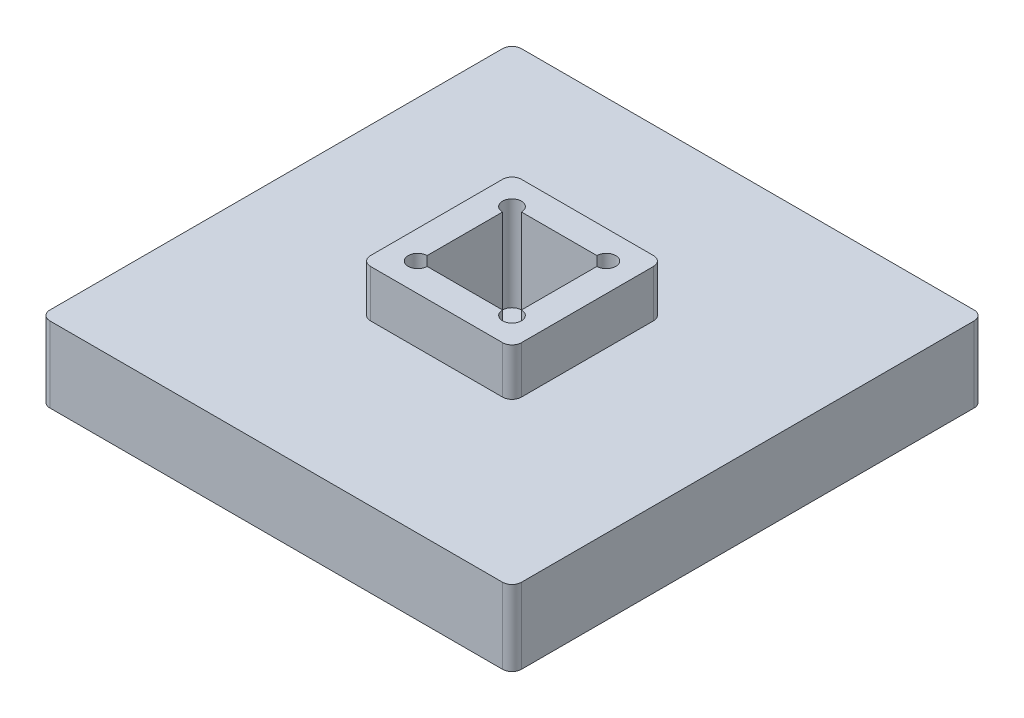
ISO-10303-21;
HEADER;
FILE_DESCRIPTION(('STEP AP214'),'2;1');
FILE_NAME('part.step','',(''),(''),'','','');
FILE_SCHEMA(('AUTOMOTIVE_DESIGN { 1 0 10303 214 1 1 1 1 }'));
ENDSEC;
DATA;
#1=APPLICATION_CONTEXT('core data for automotive mechanical design processes');
#2=APPLICATION_PROTOCOL_DEFINITION('international standard','automotive_design',2000,#1);
#3=PRODUCT_CONTEXT('',#1,'mechanical');
#4=PRODUCT('Part','Part','',(#3));
#5=PRODUCT_RELATED_PRODUCT_CATEGORY('part','',(#4));
#6=PRODUCT_DEFINITION_FORMATION('','',#4);
#7=PRODUCT_DEFINITION_CONTEXT('part definition',#1,'design');
#8=PRODUCT_DEFINITION('design','',#6,#7);
#9=PRODUCT_DEFINITION_SHAPE('','',#8);
#10=(LENGTH_UNIT() NAMED_UNIT(*) SI_UNIT(.MILLI.,.METRE.));
#11=(NAMED_UNIT(*) PLANE_ANGLE_UNIT() SI_UNIT($,.RADIAN.));
#12=(NAMED_UNIT(*) SI_UNIT($,.STERADIAN.) SOLID_ANGLE_UNIT());
#13=UNCERTAINTY_MEASURE_WITH_UNIT(LENGTH_MEASURE(1.E-05),#10,'distance_accuracy_value','');
#14=(GEOMETRIC_REPRESENTATION_CONTEXT(3) GLOBAL_UNCERTAINTY_ASSIGNED_CONTEXT((#13)) GLOBAL_UNIT_ASSIGNED_CONTEXT((#10,
#11,#12)) REPRESENTATION_CONTEXT('',''));
#15=CARTESIAN_POINT('',(0.,0.,0.));
#16=DIRECTION('',(0.,0.,1.));
#17=DIRECTION('',(1.,0.,0.));
#18=AXIS2_PLACEMENT_3D('',#15,#16,#17);
#19=CARTESIAN_POINT('',(0.,8.,0.));
#20=DIRECTION('',(0.,-1.,0.));
#21=DIRECTION('',(0.,0.,-1.));
#22=AXIS2_PLACEMENT_3D('',#19,#20,#21);
#23=PLANE('',#22);
#24=DIRECTION('',(-1.,0.,0.));
#25=VECTOR('',#24,1.);
#26=CARTESIAN_POINT('',(-25.,8.,-25.));
#27=LINE('',#26,#25);
#28=CARTESIAN_POINT('',(24.,8.,-25.));
#29=VERTEX_POINT('',#28);
#30=CARTESIAN_POINT('',(-24.,8.,-25.));
#31=VERTEX_POINT('',#30);
#32=EDGE_CURVE('E299',#29,#31,#27,.T.);
#33=ORIENTED_EDGE('',*,*,#32,.T.);
#34=CARTESIAN_POINT('',(-24.,8.,-24.));
#35=DIRECTION('',(0.,-1.,0.));
#36=DIRECTION('',(0.,0.,-1.));
#37=AXIS2_PLACEMENT_3D('',#34,#35,#36);
#38=CIRCLE('',#37,1.);
#39=CARTESIAN_POINT('',(-25.,8.,-24.));
#40=VERTEX_POINT('',#39);
#41=EDGE_CURVE('E367',#31,#40,#38,.F.);
#42=ORIENTED_EDGE('',*,*,#41,.T.);
#43=DIRECTION('',(0.,0.,1.));
#44=VECTOR('',#43,1.);
#45=CARTESIAN_POINT('',(-25.,8.,25.));
#46=LINE('',#45,#44);
#47=CARTESIAN_POINT('',(-25.,8.,24.));
#48=VERTEX_POINT('',#47);
#49=EDGE_CURVE('E303',#40,#48,#46,.T.);
#50=ORIENTED_EDGE('',*,*,#49,.T.);
#51=CARTESIAN_POINT('',(-24.,8.,24.));
#52=DIRECTION('',(0.,-1.,0.));
#53=DIRECTION('',(0.,0.,-1.));
#54=AXIS2_PLACEMENT_3D('',#51,#52,#53);
#55=CIRCLE('',#54,1.);
#56=CARTESIAN_POINT('',(-24.,8.,25.));
#57=VERTEX_POINT('',#56);
#58=EDGE_CURVE('E58',#48,#57,#55,.F.);
#59=ORIENTED_EDGE('',*,*,#58,.T.);
#60=DIRECTION('',(1.,0.,0.));
#61=VECTOR('',#60,1.);
#62=CARTESIAN_POINT('',(-25.,8.,25.));
#63=LINE('',#62,#61);
#64=CARTESIAN_POINT('',(24.,8.,25.));
#65=VERTEX_POINT('',#64);
#66=EDGE_CURVE('E305',#57,#65,#63,.T.);
#67=ORIENTED_EDGE('',*,*,#66,.T.);
#68=CARTESIAN_POINT('',(24.,8.,24.));
#69=DIRECTION('',(0.,-1.,0.));
#70=DIRECTION('',(0.,0.,-1.));
#71=AXIS2_PLACEMENT_3D('',#68,#69,#70);
#72=CIRCLE('',#71,1.);
#73=CARTESIAN_POINT('',(25.,8.,24.));
#74=VERTEX_POINT('',#73);
#75=EDGE_CURVE('E364',#65,#74,#72,.F.);
#76=ORIENTED_EDGE('',*,*,#75,.T.);
#77=DIRECTION('',(0.,0.,-1.));
#78=VECTOR('',#77,1.);
#79=CARTESIAN_POINT('',(25.,8.,25.));
#80=LINE('',#79,#78);
#81=CARTESIAN_POINT('',(25.,8.,-24.));
#82=VERTEX_POINT('',#81);
#83=EDGE_CURVE('E296',#74,#82,#80,.T.);
#84=ORIENTED_EDGE('',*,*,#83,.T.);
#85=CARTESIAN_POINT('',(24.,8.,-24.));
#86=DIRECTION('',(0.,-1.,0.));
#87=DIRECTION('',(0.,0.,-1.));
#88=AXIS2_PLACEMENT_3D('',#85,#86,#87);
#89=CIRCLE('',#88,1.);
#90=EDGE_CURVE('E362',#82,#29,#89,.F.);
#91=ORIENTED_EDGE('',*,*,#90,.T.);
#92=EDGE_LOOP('',(#33,#42,#50,#59,#67,#76,#84,#91));
#93=FACE_BOUND('',#92,.T.);
#94=DIRECTION('',(1.,0.,0.));
#95=VECTOR('',#94,1.);
#96=CARTESIAN_POINT('',(0.,8.,8.));
#97=LINE('',#96,#95);
#98=CARTESIAN_POINT('',(-7.,8.,8.));
#99=VERTEX_POINT('',#98);
#100=CARTESIAN_POINT('',(7.,8.,8.));
#101=VERTEX_POINT('',#100);
#102=EDGE_CURVE('E239',#99,#101,#97,.T.);
#103=ORIENTED_EDGE('',*,*,#102,.F.);
#104=CARTESIAN_POINT('',(-7.,8.,7.));
#105=DIRECTION('',(0.,-1.,0.));
#106=DIRECTION('',(0.,0.,-1.));
#107=AXIS2_PLACEMENT_3D('',#104,#105,#106);
#108=CIRCLE('',#107,1.);
#109=CARTESIAN_POINT('',(-8.,8.,7.));
#110=VERTEX_POINT('',#109);
#111=EDGE_CURVE('E11',#99,#110,#108,.T.);
#112=ORIENTED_EDGE('',*,*,#111,.T.);
#113=DIRECTION('',(0.,0.,-1.));
#114=VECTOR('',#113,1.);
#115=CARTESIAN_POINT('',(-8.,8.,0.));
#116=LINE('',#115,#114);
#117=CARTESIAN_POINT('',(-8.,8.,-7.));
#118=VERTEX_POINT('',#117);
#119=EDGE_CURVE('E244',#110,#118,#116,.T.);
#120=ORIENTED_EDGE('',*,*,#119,.T.);
#121=CARTESIAN_POINT('',(-7.,8.,-7.));
#122=DIRECTION('',(0.,-1.,0.));
#123=DIRECTION('',(0.,0.,-1.));
#124=AXIS2_PLACEMENT_3D('',#121,#122,#123);
#125=CIRCLE('',#124,1.);
#126=CARTESIAN_POINT('',(-7.,8.,-8.));
#127=VERTEX_POINT('',#126);
#128=EDGE_CURVE('E44',#118,#127,#125,.T.);
#129=ORIENTED_EDGE('',*,*,#128,.T.);
#130=DIRECTION('',(1.,0.,0.));
#131=VECTOR('',#130,1.);
#132=CARTESIAN_POINT('',(0.,8.,-8.));
#133=LINE('',#132,#131);
#134=CARTESIAN_POINT('',(7.,8.,-8.));
#135=VERTEX_POINT('',#134);
#136=EDGE_CURVE('E279',#127,#135,#133,.T.);
#137=ORIENTED_EDGE('',*,*,#136,.T.);
#138=CARTESIAN_POINT('',(7.,8.,-7.));
#139=DIRECTION('',(0.,-1.,0.));
#140=DIRECTION('',(0.,0.,-1.));
#141=AXIS2_PLACEMENT_3D('',#138,#139,#140);
#142=CIRCLE('',#141,1.);
#143=CARTESIAN_POINT('',(8.,8.,-7.));
#144=VERTEX_POINT('',#143);
#145=EDGE_CURVE('E380',#135,#144,#142,.T.);
#146=ORIENTED_EDGE('',*,*,#145,.T.);
#147=DIRECTION('',(0.,0.,-1.));
#148=VECTOR('',#147,1.);
#149=CARTESIAN_POINT('',(8.,8.,0.));
#150=LINE('',#149,#148);
#151=CARTESIAN_POINT('',(8.,8.,7.));
#152=VERTEX_POINT('',#151);
#153=EDGE_CURVE('E276',#152,#144,#150,.T.);
#154=ORIENTED_EDGE('',*,*,#153,.F.);
#155=CARTESIAN_POINT('',(7.,8.,7.));
#156=DIRECTION('',(0.,-1.,0.));
#157=DIRECTION('',(0.,0.,-1.));
#158=AXIS2_PLACEMENT_3D('',#155,#156,#157);
#159=CIRCLE('',#158,1.);
#160=EDGE_CURVE('E378',#152,#101,#159,.T.);
#161=ORIENTED_EDGE('',*,*,#160,.T.);
#162=EDGE_LOOP('',(#103,#112,#120,#129,#137,#146,#154,#161));
#163=FACE_BOUND('',#162,.T.);
#164=ADVANCED_FACE('F36',(#93,#163),#23,.F.);
#165=CARTESIAN_POINT('',(25.,8.,25.));
#166=DIRECTION('',(-1.,0.,0.));
#167=DIRECTION('',(0.,0.,1.));
#168=AXIS2_PLACEMENT_3D('',#165,#166,#167);
#169=PLANE('',#168);
#170=ORIENTED_EDGE('',*,*,#83,.F.);
#171=DIRECTION('',(0.,-1.,0.));
#172=VECTOR('',#171,1.);
#173=CARTESIAN_POINT('',(25.,8.,24.));
#174=LINE('',#173,#172);
#175=CARTESIAN_POINT('',(25.,0.,24.));
#176=VERTEX_POINT('',#175);
#177=EDGE_CURVE('E375',#74,#176,#174,.T.);
#178=ORIENTED_EDGE('',*,*,#177,.T.);
#179=DIRECTION('',(0.,0.,-1.));
#180=VECTOR('',#179,1.);
#181=CARTESIAN_POINT('',(25.,0.,25.));
#182=LINE('',#181,#180);
#183=CARTESIAN_POINT('',(25.,0.,-24.));
#184=VERTEX_POINT('',#183);
#185=EDGE_CURVE('E295',#176,#184,#182,.T.);
#186=ORIENTED_EDGE('',*,*,#185,.T.);
#187=DIRECTION('',(0.,-1.,0.));
#188=VECTOR('',#187,1.);
#189=CARTESIAN_POINT('',(25.,8.,-24.));
#190=LINE('',#189,#188);
#191=EDGE_CURVE('E373',#184,#82,#190,.F.);
#192=ORIENTED_EDGE('',*,*,#191,.T.);
#193=EDGE_LOOP('',(#170,#178,#186,#192));
#194=FACE_BOUND('',#193,.T.);
#195=ADVANCED_FACE('F429',(#194),#169,.F.);
#196=CARTESIAN_POINT('',(-25.,8.,-25.));
#197=DIRECTION('',(0.,0.,1.));
#198=DIRECTION('',(1.,0.,0.));
#199=AXIS2_PLACEMENT_3D('',#196,#197,#198);
#200=PLANE('',#199);
#201=DIRECTION('',(-1.,0.,0.));
#202=VECTOR('',#201,1.);
#203=CARTESIAN_POINT('',(-25.,0.,-25.));
#204=LINE('',#203,#202);
#205=CARTESIAN_POINT('',(24.,0.,-25.));
#206=VERTEX_POINT('',#205);
#207=CARTESIAN_POINT('',(-24.,0.,-25.));
#208=VERTEX_POINT('',#207);
#209=EDGE_CURVE('E310',#206,#208,#204,.T.);
#210=ORIENTED_EDGE('',*,*,#209,.T.);
#211=DIRECTION('',(0.,-1.,0.));
#212=VECTOR('',#211,1.);
#213=CARTESIAN_POINT('',(-24.,8.,-25.));
#214=LINE('',#213,#212);
#215=EDGE_CURVE('E360',#208,#31,#214,.F.);
#216=ORIENTED_EDGE('',*,*,#215,.T.);
#217=ORIENTED_EDGE('',*,*,#32,.F.);
#218=DIRECTION('',(0.,-1.,0.));
#219=VECTOR('',#218,1.);
#220=CARTESIAN_POINT('',(24.,8.,-25.));
#221=LINE('',#220,#219);
#222=EDGE_CURVE('E357',#29,#206,#221,.T.);
#223=ORIENTED_EDGE('',*,*,#222,.T.);
#224=EDGE_LOOP('',(#210,#216,#217,#223));
#225=FACE_BOUND('',#224,.T.);
#226=ADVANCED_FACE('F434',(#225),#200,.F.);
#227=CARTESIAN_POINT('',(-25.,8.,25.));
#228=DIRECTION('',(1.,0.,0.));
#229=DIRECTION('',(0.,0.,-1.));
#230=AXIS2_PLACEMENT_3D('',#227,#228,#229);
#231=PLANE('',#230);
#232=ORIENTED_EDGE('',*,*,#49,.F.);
#233=DIRECTION('',(0.,-1.,0.));
#234=VECTOR('',#233,1.);
#235=CARTESIAN_POINT('',(-25.,8.,-24.));
#236=LINE('',#235,#234);
#237=CARTESIAN_POINT('',(-25.,0.,-24.));
#238=VERTEX_POINT('',#237);
#239=EDGE_CURVE('E346',#40,#238,#236,.T.);
#240=ORIENTED_EDGE('',*,*,#239,.T.);
#241=DIRECTION('',(0.,0.,1.));
#242=VECTOR('',#241,1.);
#243=CARTESIAN_POINT('',(-25.,0.,25.));
#244=LINE('',#243,#242);
#245=CARTESIAN_POINT('',(-25.,0.,24.));
#246=VERTEX_POINT('',#245);
#247=EDGE_CURVE('E313',#238,#246,#244,.T.);
#248=ORIENTED_EDGE('',*,*,#247,.T.);
#249=DIRECTION('',(0.,-1.,0.));
#250=VECTOR('',#249,1.);
#251=CARTESIAN_POINT('',(-25.,8.,24.));
#252=LINE('',#251,#250);
#253=EDGE_CURVE('E344',#246,#48,#252,.F.);
#254=ORIENTED_EDGE('',*,*,#253,.T.);
#255=EDGE_LOOP('',(#232,#240,#248,#254));
#256=FACE_BOUND('',#255,.T.);
#257=ADVANCED_FACE('F448',(#256),#231,.F.);
#258=CARTESIAN_POINT('',(-25.,8.,25.));
#259=DIRECTION('',(0.,0.,-1.));
#260=DIRECTION('',(-1.,0.,0.));
#261=AXIS2_PLACEMENT_3D('',#258,#259,#260);
#262=PLANE('',#261);
#263=ORIENTED_EDGE('',*,*,#66,.F.);
#264=DIRECTION('',(0.,-1.,0.));
#265=VECTOR('',#264,1.);
#266=CARTESIAN_POINT('',(-24.,8.,25.));
#267=LINE('',#266,#265);
#268=CARTESIAN_POINT('',(-24.,0.,25.));
#269=VERTEX_POINT('',#268);
#270=EDGE_CURVE('E370',#57,#269,#267,.T.);
#271=ORIENTED_EDGE('',*,*,#270,.T.);
#272=DIRECTION('',(1.,0.,0.));
#273=VECTOR('',#272,1.);
#274=CARTESIAN_POINT('',(-25.,0.,25.));
#275=LINE('',#274,#273);
#276=CARTESIAN_POINT('',(24.,0.,25.));
#277=VERTEX_POINT('',#276);
#278=EDGE_CURVE('E300',#269,#277,#275,.T.);
#279=ORIENTED_EDGE('',*,*,#278,.T.);
#280=DIRECTION('',(0.,-1.,0.));
#281=VECTOR('',#280,1.);
#282=CARTESIAN_POINT('',(24.,8.,25.));
#283=LINE('',#282,#281);
#284=EDGE_CURVE('E51',#277,#65,#283,.F.);
#285=ORIENTED_EDGE('',*,*,#284,.T.);
#286=EDGE_LOOP('',(#263,#271,#279,#285));
#287=FACE_BOUND('',#286,.T.);
#288=ADVANCED_FACE('F444',(#287),#262,.F.);
#289=CARTESIAN_POINT('',(0.,0.,0.));
#290=DIRECTION('',(0.,-1.,0.));
#291=DIRECTION('',(0.,0.,-1.));
#292=AXIS2_PLACEMENT_3D('',#289,#290,#291);
#293=PLANE('',#292);
#294=ORIENTED_EDGE('',*,*,#247,.F.);
#295=CARTESIAN_POINT('',(-24.,0.,-24.));
#296=DIRECTION('',(0.,-1.,0.));
#297=DIRECTION('',(0.,0.,-1.));
#298=AXIS2_PLACEMENT_3D('',#295,#296,#297);
#299=CIRCLE('',#298,1.);
#300=EDGE_CURVE('E355',#238,#208,#299,.T.);
#301=ORIENTED_EDGE('',*,*,#300,.T.);
#302=ORIENTED_EDGE('',*,*,#209,.F.);
#303=CARTESIAN_POINT('',(24.,0.,-24.));
#304=DIRECTION('',(0.,-1.,0.));
#305=DIRECTION('',(0.,0.,-1.));
#306=AXIS2_PLACEMENT_3D('',#303,#304,#305);
#307=CIRCLE('',#306,1.);
#308=EDGE_CURVE('E349',#206,#184,#307,.T.);
#309=ORIENTED_EDGE('',*,*,#308,.T.);
#310=ORIENTED_EDGE('',*,*,#185,.F.);
#311=CARTESIAN_POINT('',(24.,0.,24.));
#312=DIRECTION('',(0.,-1.,0.));
#313=DIRECTION('',(0.,0.,-1.));
#314=AXIS2_PLACEMENT_3D('',#311,#312,#313);
#315=CIRCLE('',#314,1.);
#316=EDGE_CURVE('E351',#176,#277,#315,.T.);
#317=ORIENTED_EDGE('',*,*,#316,.T.);
#318=ORIENTED_EDGE('',*,*,#278,.F.);
#319=CARTESIAN_POINT('',(-24.,0.,24.));
#320=DIRECTION('',(0.,-1.,0.));
#321=DIRECTION('',(0.,0.,-1.));
#322=AXIS2_PLACEMENT_3D('',#319,#320,#321);
#323=CIRCLE('',#322,1.);
#324=EDGE_CURVE('E353',#269,#246,#323,.T.);
#325=ORIENTED_EDGE('',*,*,#324,.T.);
#326=EDGE_LOOP('',(#294,#301,#302,#309,#310,#317,#318,#325));
#327=FACE_BOUND('',#326,.T.);
#328=ADVANCED_FACE('F441',(#327),#293,.T.);
#329=CARTESIAN_POINT('',(0.,13.,8.));
#330=DIRECTION('',(0.,0.,-1.));
#331=DIRECTION('',(-1.,0.,0.));
#332=AXIS2_PLACEMENT_3D('',#329,#330,#331);
#333=PLANE('',#332);
#334=ORIENTED_EDGE('',*,*,#102,.T.);
#335=DIRECTION('',(0.,-1.,0.));
#336=VECTOR('',#335,1.);
#337=CARTESIAN_POINT('',(7.,13.,8.));
#338=LINE('',#337,#336);
#339=CARTESIAN_POINT('',(7.,13.,8.));
#340=VERTEX_POINT('',#339);
#341=EDGE_CURVE('E324',#101,#340,#338,.F.);
#342=ORIENTED_EDGE('',*,*,#341,.T.);
#343=DIRECTION('',(1.,0.,0.));
#344=VECTOR('',#343,1.);
#345=CARTESIAN_POINT('',(0.,13.,8.));
#346=LINE('',#345,#344);
#347=CARTESIAN_POINT('',(-7.,13.,8.));
#348=VERTEX_POINT('',#347);
#349=EDGE_CURVE('E261',#348,#340,#346,.T.);
#350=ORIENTED_EDGE('',*,*,#349,.F.);
#351=DIRECTION('',(0.,-1.,0.));
#352=VECTOR('',#351,1.);
#353=CARTESIAN_POINT('',(-7.,8.,8.));
#354=LINE('',#353,#352);
#355=EDGE_CURVE('E321',#348,#99,#354,.T.);
#356=ORIENTED_EDGE('',*,*,#355,.T.);
#357=EDGE_LOOP('',(#334,#342,#350,#356));
#358=FACE_BOUND('',#357,.T.);
#359=ADVANCED_FACE('F407',(#358),#333,.F.);
#360=CARTESIAN_POINT('',(8.,13.,0.));
#361=DIRECTION('',(-1.,0.,0.));
#362=DIRECTION('',(0.,0.,1.));
#363=AXIS2_PLACEMENT_3D('',#360,#361,#362);
#364=PLANE('',#363);
#365=DIRECTION('',(0.,0.,-1.));
#366=VECTOR('',#365,1.);
#367=CARTESIAN_POINT('',(8.,13.,0.));
#368=LINE('',#367,#366);
#369=CARTESIAN_POINT('',(8.,13.,7.));
#370=VERTEX_POINT('',#369);
#371=CARTESIAN_POINT('',(8.,13.,-7.));
#372=VERTEX_POINT('',#371);
#373=EDGE_CURVE('E264',#370,#372,#368,.T.);
#374=ORIENTED_EDGE('',*,*,#373,.F.);
#375=DIRECTION('',(0.,-1.,0.));
#376=VECTOR('',#375,1.);
#377=CARTESIAN_POINT('',(8.,13.,7.));
#378=LINE('',#377,#376);
#379=EDGE_CURVE('E318',#370,#152,#378,.T.);
#380=ORIENTED_EDGE('',*,*,#379,.T.);
#381=ORIENTED_EDGE('',*,*,#153,.T.);
#382=DIRECTION('',(0.,-1.,0.));
#383=VECTOR('',#382,1.);
#384=CARTESIAN_POINT('',(8.,13.,-7.));
#385=LINE('',#384,#383);
#386=EDGE_CURVE('E307',#144,#372,#385,.F.);
#387=ORIENTED_EDGE('',*,*,#386,.T.);
#388=EDGE_LOOP('',(#374,#380,#381,#387));
#389=FACE_BOUND('',#388,.T.);
#390=ADVANCED_FACE('F415',(#389),#364,.F.);
#391=CARTESIAN_POINT('',(0.,13.,-8.));
#392=DIRECTION('',(0.,0.,-1.));
#393=DIRECTION('',(-1.,0.,0.));
#394=AXIS2_PLACEMENT_3D('',#391,#392,#393);
#395=PLANE('',#394);
#396=DIRECTION('',(1.,0.,0.));
#397=VECTOR('',#396,1.);
#398=CARTESIAN_POINT('',(0.,13.,-8.));
#399=LINE('',#398,#397);
#400=CARTESIAN_POINT('',(-7.,13.,-8.));
#401=VERTEX_POINT('',#400);
#402=CARTESIAN_POINT('',(7.,13.,-8.));
#403=VERTEX_POINT('',#402);
#404=EDGE_CURVE('E267',#401,#403,#399,.T.);
#405=ORIENTED_EDGE('',*,*,#404,.T.);
#406=DIRECTION('',(0.,-1.,0.));
#407=VECTOR('',#406,1.);
#408=CARTESIAN_POINT('',(7.,8.,-8.));
#409=LINE('',#408,#407);
#410=EDGE_CURVE('E336',#403,#135,#409,.T.);
#411=ORIENTED_EDGE('',*,*,#410,.T.);
#412=ORIENTED_EDGE('',*,*,#136,.F.);
#413=DIRECTION('',(0.,-1.,0.));
#414=VECTOR('',#413,1.);
#415=CARTESIAN_POINT('',(-7.,13.,-8.));
#416=LINE('',#415,#414);
#417=EDGE_CURVE('E334',#127,#401,#416,.F.);
#418=ORIENTED_EDGE('',*,*,#417,.T.);
#419=EDGE_LOOP('',(#405,#411,#412,#418));
#420=FACE_BOUND('',#419,.T.);
#421=ADVANCED_FACE('F389',(#420),#395,.T.);
#422=CARTESIAN_POINT('',(-5.,13.,5.));
#423=DIRECTION('',(0.,-1.,0.));
#424=DIRECTION('',(0.,0.,-1.));
#425=AXIS2_PLACEMENT_3D('',#422,#423,#424);
#426=CYLINDRICAL_SURFACE('',#425,1.);
#427=DIRECTION('',(0.,-1.,0.));
#428=VECTOR('',#427,1.);
#429=CARTESIAN_POINT('',(-4.,13.,5.));
#430=LINE('',#429,#428);
#431=CARTESIAN_POINT('',(-4.,13.,5.));
#432=VERTEX_POINT('',#431);
#433=CARTESIAN_POINT('',(-4.,3.,5.));
#434=VERTEX_POINT('',#433);
#435=EDGE_CURVE('E273',#432,#434,#430,.T.);
#436=ORIENTED_EDGE('',*,*,#435,.T.);
#437=CARTESIAN_POINT('',(-5.,3.,5.));
#438=DIRECTION('',(0.,1.,0.));
#439=DIRECTION('',(0.,0.,1.));
#440=AXIS2_PLACEMENT_3D('',#437,#438,#439);
#441=CIRCLE('',#440,1.);
#442=CARTESIAN_POINT('',(-5.,3.,4.));
#443=VERTEX_POINT('',#442);
#444=EDGE_CURVE('E218',#443,#434,#441,.T.);
#445=ORIENTED_EDGE('',*,*,#444,.F.);
#446=DIRECTION('',(0.,-1.,0.));
#447=VECTOR('',#446,1.);
#448=CARTESIAN_POINT('',(-5.,13.,4.));
#449=LINE('',#448,#447);
#450=CARTESIAN_POINT('',(-5.,13.,4.));
#451=VERTEX_POINT('',#450);
#452=EDGE_CURVE('E209',#451,#443,#449,.T.);
#453=ORIENTED_EDGE('',*,*,#452,.F.);
#454=CARTESIAN_POINT('',(-5.,13.,5.));
#455=DIRECTION('',(0.,1.,0.));
#456=DIRECTION('',(0.,0.,1.));
#457=AXIS2_PLACEMENT_3D('',#454,#455,#456);
#458=CIRCLE('',#457,1.);
#459=EDGE_CURVE('E240',#451,#432,#458,.T.);
#460=ORIENTED_EDGE('',*,*,#459,.T.);
#461=EDGE_LOOP('',(#436,#445,#453,#460));
#462=FACE_BOUND('',#461,.T.);
#463=ADVANCED_FACE('F439',(#462),#426,.F.);
#464=CARTESIAN_POINT('',(-5.,13.,0.));
#465=DIRECTION('',(-1.,0.,0.));
#466=DIRECTION('',(0.,0.,1.));
#467=AXIS2_PLACEMENT_3D('',#464,#465,#466);
#468=PLANE('',#467);
#469=ORIENTED_EDGE('',*,*,#452,.T.);
#470=DIRECTION('',(0.,0.,1.));
#471=VECTOR('',#470,1.);
#472=CARTESIAN_POINT('',(-5.,3.,-4.));
#473=LINE('',#472,#471);
#474=CARTESIAN_POINT('',(-5.,3.,-4.));
#475=VERTEX_POINT('',#474);
#476=EDGE_CURVE('E213',#475,#443,#473,.T.);
#477=ORIENTED_EDGE('',*,*,#476,.F.);
#478=DIRECTION('',(0.,-1.,0.));
#479=VECTOR('',#478,1.);
#480=CARTESIAN_POINT('',(-5.,13.,-4.));
#481=LINE('',#480,#479);
#482=CARTESIAN_POINT('',(-5.,13.,-4.));
#483=VERTEX_POINT('',#482);
#484=EDGE_CURVE('E199',#483,#475,#481,.T.);
#485=ORIENTED_EDGE('',*,*,#484,.F.);
#486=DIRECTION('',(0.,0.,-1.));
#487=VECTOR('',#486,1.);
#488=CARTESIAN_POINT('',(-5.,13.,0.));
#489=LINE('',#488,#487);
#490=EDGE_CURVE('E243',#451,#483,#489,.T.);
#491=ORIENTED_EDGE('',*,*,#490,.F.);
#492=EDGE_LOOP('',(#469,#477,#485,#491));
#493=FACE_BOUND('',#492,.T.);
#494=ADVANCED_FACE('F214',(#493),#468,.F.);
#495=CARTESIAN_POINT('',(-5.,13.,-5.));
#496=DIRECTION('',(0.,-1.,0.));
#497=DIRECTION('',(0.,0.,-1.));
#498=AXIS2_PLACEMENT_3D('',#495,#496,#497);
#499=CYLINDRICAL_SURFACE('',#498,1.);
#500=ORIENTED_EDGE('',*,*,#484,.T.);
#501=CARTESIAN_POINT('',(-5.,3.,-5.));
#502=DIRECTION('',(0.,1.,0.));
#503=DIRECTION('',(0.,0.,1.));
#504=AXIS2_PLACEMENT_3D('',#501,#502,#503);
#505=CIRCLE('',#504,1.);
#506=CARTESIAN_POINT('',(-4.,3.,-5.));
#507=VERTEX_POINT('',#506);
#508=EDGE_CURVE('E203',#507,#475,#505,.T.);
#509=ORIENTED_EDGE('',*,*,#508,.F.);
#510=DIRECTION('',(0.,-1.,0.));
#511=VECTOR('',#510,1.);
#512=CARTESIAN_POINT('',(-4.,13.,-5.));
#513=LINE('',#512,#511);
#514=CARTESIAN_POINT('',(-4.,13.,-5.));
#515=VERTEX_POINT('',#514);
#516=EDGE_CURVE('E210',#515,#507,#513,.T.);
#517=ORIENTED_EDGE('',*,*,#516,.F.);
#518=CARTESIAN_POINT('',(-5.,13.,-5.));
#519=DIRECTION('',(0.,1.,0.));
#520=DIRECTION('',(0.,0.,1.));
#521=AXIS2_PLACEMENT_3D('',#518,#519,#520);
#522=CIRCLE('',#521,1.);
#523=EDGE_CURVE('E206',#515,#483,#522,.T.);
#524=ORIENTED_EDGE('',*,*,#523,.T.);
#525=EDGE_LOOP('',(#500,#509,#517,#524));
#526=FACE_BOUND('',#525,.T.);
#527=ADVANCED_FACE('F201',(#526),#499,.F.);
#528=CARTESIAN_POINT('',(0.,13.,-5.));
#529=DIRECTION('',(0.,0.,-1.));
#530=DIRECTION('',(-1.,0.,0.));
#531=AXIS2_PLACEMENT_3D('',#528,#529,#530);
#532=PLANE('',#531);
#533=ORIENTED_EDGE('',*,*,#516,.T.);
#534=DIRECTION('',(-1.,0.,0.));
#535=VECTOR('',#534,1.);
#536=CARTESIAN_POINT('',(4.,3.,-5.));
#537=LINE('',#536,#535);
#538=CARTESIAN_POINT('',(4.,3.,-5.));
#539=VERTEX_POINT('',#538);
#540=EDGE_CURVE('E223',#539,#507,#537,.T.);
#541=ORIENTED_EDGE('',*,*,#540,.F.);
#542=DIRECTION('',(0.,-1.,0.));
#543=VECTOR('',#542,1.);
#544=CARTESIAN_POINT('',(4.,13.,-5.));
#545=LINE('',#544,#543);
#546=CARTESIAN_POINT('',(4.,13.,-5.));
#547=VERTEX_POINT('',#546);
#548=EDGE_CURVE('E291',#547,#539,#545,.T.);
#549=ORIENTED_EDGE('',*,*,#548,.F.);
#550=DIRECTION('',(1.,0.,0.));
#551=VECTOR('',#550,1.);
#552=CARTESIAN_POINT('',(0.,13.,-5.));
#553=LINE('',#552,#551);
#554=EDGE_CURVE('E247',#515,#547,#553,.T.);
#555=ORIENTED_EDGE('',*,*,#554,.F.);
#556=EDGE_LOOP('',(#533,#541,#549,#555));
#557=FACE_BOUND('',#556,.T.);
#558=ADVANCED_FACE('F541',(#557),#532,.F.);
#559=CARTESIAN_POINT('',(5.,13.,-5.));
#560=DIRECTION('',(0.,-1.,0.));
#561=DIRECTION('',(0.,0.,-1.));
#562=AXIS2_PLACEMENT_3D('',#559,#560,#561);
#563=CYLINDRICAL_SURFACE('',#562,1.);
#564=ORIENTED_EDGE('',*,*,#548,.T.);
#565=CARTESIAN_POINT('',(5.,3.,-5.));
#566=DIRECTION('',(0.,1.,0.));
#567=DIRECTION('',(0.,0.,1.));
#568=AXIS2_PLACEMENT_3D('',#565,#566,#567);
#569=CIRCLE('',#568,1.);
#570=CARTESIAN_POINT('',(5.,3.,-4.));
#571=VERTEX_POINT('',#570);
#572=EDGE_CURVE('E236',#571,#539,#569,.T.);
#573=ORIENTED_EDGE('',*,*,#572,.F.);
#574=DIRECTION('',(0.,-1.,0.));
#575=VECTOR('',#574,1.);
#576=CARTESIAN_POINT('',(5.,13.,-4.));
#577=LINE('',#576,#575);
#578=CARTESIAN_POINT('',(5.,13.,-4.));
#579=VERTEX_POINT('',#578);
#580=EDGE_CURVE('E289',#579,#571,#577,.T.);
#581=ORIENTED_EDGE('',*,*,#580,.F.);
#582=CARTESIAN_POINT('',(5.,13.,-5.));
#583=DIRECTION('',(0.,1.,0.));
#584=DIRECTION('',(0.,0.,1.));
#585=AXIS2_PLACEMENT_3D('',#582,#583,#584);
#586=CIRCLE('',#585,1.);
#587=EDGE_CURVE('E249',#579,#547,#586,.T.);
#588=ORIENTED_EDGE('',*,*,#587,.T.);
#589=EDGE_LOOP('',(#564,#573,#581,#588));
#590=FACE_BOUND('',#589,.T.);
#591=ADVANCED_FACE('F551',(#590),#563,.F.);
#592=CARTESIAN_POINT('',(5.,13.,0.));
#593=DIRECTION('',(-1.,0.,0.));
#594=DIRECTION('',(0.,0.,1.));
#595=AXIS2_PLACEMENT_3D('',#592,#593,#594);
#596=PLANE('',#595);
#597=ORIENTED_EDGE('',*,*,#580,.T.);
#598=DIRECTION('',(0.,0.,-1.));
#599=VECTOR('',#598,1.);
#600=CARTESIAN_POINT('',(5.,3.,4.));
#601=LINE('',#600,#599);
#602=CARTESIAN_POINT('',(5.,3.,4.));
#603=VERTEX_POINT('',#602);
#604=EDGE_CURVE('E233',#603,#571,#601,.T.);
#605=ORIENTED_EDGE('',*,*,#604,.F.);
#606=DIRECTION('',(0.,-1.,0.));
#607=VECTOR('',#606,1.);
#608=CARTESIAN_POINT('',(5.,13.,4.));
#609=LINE('',#608,#607);
#610=CARTESIAN_POINT('',(5.,13.,4.));
#611=VERTEX_POINT('',#610);
#612=EDGE_CURVE('E287',#611,#603,#609,.T.);
#613=ORIENTED_EDGE('',*,*,#612,.F.);
#614=DIRECTION('',(0.,0.,-1.));
#615=VECTOR('',#614,1.);
#616=CARTESIAN_POINT('',(5.,13.,0.));
#617=LINE('',#616,#615);
#618=EDGE_CURVE('E252',#611,#579,#617,.T.);
#619=ORIENTED_EDGE('',*,*,#618,.T.);
#620=EDGE_LOOP('',(#597,#605,#613,#619));
#621=FACE_BOUND('',#620,.T.);
#622=ADVANCED_FACE('F562',(#621),#596,.T.);
#623=CARTESIAN_POINT('',(5.,13.,5.));
#624=DIRECTION('',(0.,-1.,0.));
#625=DIRECTION('',(0.,0.,-1.));
#626=AXIS2_PLACEMENT_3D('',#623,#624,#625);
#627=CYLINDRICAL_SURFACE('',#626,1.);
#628=ORIENTED_EDGE('',*,*,#612,.T.);
#629=CARTESIAN_POINT('',(5.,3.,5.));
#630=DIRECTION('',(0.,1.,0.));
#631=DIRECTION('',(0.,0.,1.));
#632=AXIS2_PLACEMENT_3D('',#629,#630,#631);
#633=CIRCLE('',#632,1.);
#634=CARTESIAN_POINT('',(4.,3.,5.));
#635=VERTEX_POINT('',#634);
#636=EDGE_CURVE('E230',#635,#603,#633,.T.);
#637=ORIENTED_EDGE('',*,*,#636,.F.);
#638=DIRECTION('',(0.,-1.,0.));
#639=VECTOR('',#638,1.);
#640=CARTESIAN_POINT('',(4.,13.,5.));
#641=LINE('',#640,#639);
#642=CARTESIAN_POINT('',(4.,13.,5.));
#643=VERTEX_POINT('',#642);
#644=EDGE_CURVE('E285',#643,#635,#641,.T.);
#645=ORIENTED_EDGE('',*,*,#644,.F.);
#646=CARTESIAN_POINT('',(5.,13.,5.));
#647=DIRECTION('',(0.,1.,0.));
#648=DIRECTION('',(0.,0.,1.));
#649=AXIS2_PLACEMENT_3D('',#646,#647,#648);
#650=CIRCLE('',#649,1.);
#651=EDGE_CURVE('E255',#643,#611,#650,.T.);
#652=ORIENTED_EDGE('',*,*,#651,.T.);
#653=EDGE_LOOP('',(#628,#637,#645,#652));
#654=FACE_BOUND('',#653,.T.);
#655=ADVANCED_FACE('F573',(#654),#627,.F.);
#656=CARTESIAN_POINT('',(0.,13.,5.));
#657=DIRECTION('',(0.,0.,-1.));
#658=DIRECTION('',(-1.,0.,0.));
#659=AXIS2_PLACEMENT_3D('',#656,#657,#658);
#660=PLANE('',#659);
#661=ORIENTED_EDGE('',*,*,#644,.T.);
#662=DIRECTION('',(1.,0.,0.));
#663=VECTOR('',#662,1.);
#664=CARTESIAN_POINT('',(-4.,3.,5.));
#665=LINE('',#664,#663);
#666=EDGE_CURVE('E227',#434,#635,#665,.T.);
#667=ORIENTED_EDGE('',*,*,#666,.F.);
#668=ORIENTED_EDGE('',*,*,#435,.F.);
#669=DIRECTION('',(1.,0.,0.));
#670=VECTOR('',#669,1.);
#671=CARTESIAN_POINT('',(0.,13.,5.));
#672=LINE('',#671,#670);
#673=EDGE_CURVE('E258',#432,#643,#672,.T.);
#674=ORIENTED_EDGE('',*,*,#673,.T.);
#675=EDGE_LOOP('',(#661,#667,#668,#674));
#676=FACE_BOUND('',#675,.T.);
#677=ADVANCED_FACE('F584',(#676),#660,.T.);
#678=CARTESIAN_POINT('',(-8.,13.,0.));
#679=DIRECTION('',(-1.,0.,0.));
#680=DIRECTION('',(0.,0.,1.));
#681=AXIS2_PLACEMENT_3D('',#678,#679,#680);
#682=PLANE('',#681);
#683=DIRECTION('',(0.,0.,-1.));
#684=VECTOR('',#683,1.);
#685=CARTESIAN_POINT('',(-8.,13.,0.));
#686=LINE('',#685,#684);
#687=CARTESIAN_POINT('',(-8.,13.,7.));
#688=VERTEX_POINT('',#687);
#689=CARTESIAN_POINT('',(-8.,13.,-7.));
#690=VERTEX_POINT('',#689);
#691=EDGE_CURVE('E270',#688,#690,#686,.T.);
#692=ORIENTED_EDGE('',*,*,#691,.T.);
#693=DIRECTION('',(0.,-1.,0.));
#694=VECTOR('',#693,1.);
#695=CARTESIAN_POINT('',(-8.,13.,-7.));
#696=LINE('',#695,#694);
#697=EDGE_CURVE('E341',#690,#118,#696,.T.);
#698=ORIENTED_EDGE('',*,*,#697,.T.);
#699=ORIENTED_EDGE('',*,*,#119,.F.);
#700=DIRECTION('',(0.,-1.,0.));
#701=VECTOR('',#700,1.);
#702=CARTESIAN_POINT('',(-8.,13.,7.));
#703=LINE('',#702,#701);
#704=EDGE_CURVE('E339',#110,#688,#703,.F.);
#705=ORIENTED_EDGE('',*,*,#704,.T.);
#706=EDGE_LOOP('',(#692,#698,#699,#705));
#707=FACE_BOUND('',#706,.T.);
#708=ADVANCED_FACE('F399',(#707),#682,.T.);
#709=CARTESIAN_POINT('',(0.,13.,0.));
#710=DIRECTION('',(0.,1.,0.));
#711=DIRECTION('',(0.,0.,1.));
#712=AXIS2_PLACEMENT_3D('',#709,#710,#711);
#713=PLANE('',#712);
#714=ORIENTED_EDGE('',*,*,#459,.F.);
#715=ORIENTED_EDGE('',*,*,#490,.T.);
#716=ORIENTED_EDGE('',*,*,#523,.F.);
#717=ORIENTED_EDGE('',*,*,#554,.T.);
#718=ORIENTED_EDGE('',*,*,#587,.F.);
#719=ORIENTED_EDGE('',*,*,#618,.F.);
#720=ORIENTED_EDGE('',*,*,#651,.F.);
#721=ORIENTED_EDGE('',*,*,#673,.F.);
#722=EDGE_LOOP('',(#714,#715,#716,#717,#718,#719,#720,#721));
#723=FACE_BOUND('',#722,.T.);
#724=ORIENTED_EDGE('',*,*,#349,.T.);
#725=CARTESIAN_POINT('',(7.,13.,7.));
#726=DIRECTION('',(0.,1.,0.));
#727=DIRECTION('',(0.,0.,1.));
#728=AXIS2_PLACEMENT_3D('',#725,#726,#727);
#729=CIRCLE('',#728,1.);
#730=EDGE_CURVE('E332',#340,#370,#729,.T.);
#731=ORIENTED_EDGE('',*,*,#730,.T.);
#732=ORIENTED_EDGE('',*,*,#373,.T.);
#733=CARTESIAN_POINT('',(7.,13.,-7.));
#734=DIRECTION('',(0.,1.,0.));
#735=DIRECTION('',(0.,0.,1.));
#736=AXIS2_PLACEMENT_3D('',#733,#734,#735);
#737=CIRCLE('',#736,1.);
#738=EDGE_CURVE('E330',#372,#403,#737,.T.);
#739=ORIENTED_EDGE('',*,*,#738,.T.);
#740=ORIENTED_EDGE('',*,*,#404,.F.);
#741=CARTESIAN_POINT('',(-7.,13.,-7.));
#742=DIRECTION('',(0.,1.,0.));
#743=DIRECTION('',(0.,0.,1.));
#744=AXIS2_PLACEMENT_3D('',#741,#742,#743);
#745=CIRCLE('',#744,1.);
#746=EDGE_CURVE('E328',#401,#690,#745,.T.);
#747=ORIENTED_EDGE('',*,*,#746,.T.);
#748=ORIENTED_EDGE('',*,*,#691,.F.);
#749=CARTESIAN_POINT('',(-7.,13.,7.));
#750=DIRECTION('',(0.,1.,0.));
#751=DIRECTION('',(0.,0.,1.));
#752=AXIS2_PLACEMENT_3D('',#749,#750,#751);
#753=CIRCLE('',#752,1.);
#754=EDGE_CURVE('E326',#688,#348,#753,.T.);
#755=ORIENTED_EDGE('',*,*,#754,.T.);
#756=EDGE_LOOP('',(#724,#731,#732,#739,#740,#747,#748,#755));
#757=FACE_BOUND('',#756,.T.);
#758=ADVANCED_FACE('F396',(#723,#757),#713,.T.);
#759=CARTESIAN_POINT('',(7.,13.,7.));
#760=DIRECTION('',(0.,-1.,0.));
#761=DIRECTION('',(0.,0.,-1.));
#762=AXIS2_PLACEMENT_3D('',#759,#760,#761);
#763=CYLINDRICAL_SURFACE('',#762,1.);
#764=ORIENTED_EDGE('',*,*,#730,.F.);
#765=ORIENTED_EDGE('',*,*,#341,.F.);
#766=ORIENTED_EDGE('',*,*,#160,.F.);
#767=ORIENTED_EDGE('',*,*,#379,.F.);
#768=EDGE_LOOP('',(#764,#765,#766,#767));
#769=FACE_BOUND('',#768,.T.);
#770=ADVANCED_FACE('F410',(#769),#763,.T.);
#771=CARTESIAN_POINT('',(7.,13.,-7.));
#772=DIRECTION('',(0.,1.,0.));
#773=DIRECTION('',(0.,0.,1.));
#774=AXIS2_PLACEMENT_3D('',#771,#772,#773);
#775=CYLINDRICAL_SURFACE('',#774,1.);
#776=ORIENTED_EDGE('',*,*,#738,.F.);
#777=ORIENTED_EDGE('',*,*,#386,.F.);
#778=ORIENTED_EDGE('',*,*,#145,.F.);
#779=ORIENTED_EDGE('',*,*,#410,.F.);
#780=EDGE_LOOP('',(#776,#777,#778,#779));
#781=FACE_BOUND('',#780,.T.);
#782=ADVANCED_FACE('F419',(#781),#775,.T.);
#783=CARTESIAN_POINT('',(-7.,13.,-7.));
#784=DIRECTION('',(0.,-1.,0.));
#785=DIRECTION('',(0.,0.,-1.));
#786=AXIS2_PLACEMENT_3D('',#783,#784,#785);
#787=CYLINDRICAL_SURFACE('',#786,1.);
#788=ORIENTED_EDGE('',*,*,#746,.F.);
#789=ORIENTED_EDGE('',*,*,#417,.F.);
#790=ORIENTED_EDGE('',*,*,#128,.F.);
#791=ORIENTED_EDGE('',*,*,#697,.F.);
#792=EDGE_LOOP('',(#788,#789,#790,#791));
#793=FACE_BOUND('',#792,.T.);
#794=ADVANCED_FACE('F393',(#793),#787,.T.);
#795=CARTESIAN_POINT('',(-7.,13.,7.));
#796=DIRECTION('',(0.,1.,0.));
#797=DIRECTION('',(0.,0.,1.));
#798=AXIS2_PLACEMENT_3D('',#795,#796,#797);
#799=CYLINDRICAL_SURFACE('',#798,1.);
#800=ORIENTED_EDGE('',*,*,#754,.F.);
#801=ORIENTED_EDGE('',*,*,#704,.F.);
#802=ORIENTED_EDGE('',*,*,#111,.F.);
#803=ORIENTED_EDGE('',*,*,#355,.F.);
#804=EDGE_LOOP('',(#800,#801,#802,#803));
#805=FACE_BOUND('',#804,.T.);
#806=ADVANCED_FACE('F402',(#805),#799,.T.);
#807=CARTESIAN_POINT('',(-24.,8.,-24.));
#808=DIRECTION('',(0.,-1.,0.));
#809=DIRECTION('',(0.,0.,-1.));
#810=AXIS2_PLACEMENT_3D('',#807,#808,#809);
#811=CYLINDRICAL_SURFACE('',#810,1.);
#812=ORIENTED_EDGE('',*,*,#41,.F.);
#813=ORIENTED_EDGE('',*,*,#215,.F.);
#814=ORIENTED_EDGE('',*,*,#300,.F.);
#815=ORIENTED_EDGE('',*,*,#239,.F.);
#816=EDGE_LOOP('',(#812,#813,#814,#815));
#817=FACE_BOUND('',#816,.T.);
#818=ADVANCED_FACE('F462',(#817),#811,.T.);
#819=CARTESIAN_POINT('',(-24.,8.,24.));
#820=DIRECTION('',(0.,-1.,0.));
#821=DIRECTION('',(0.,0.,-1.));
#822=AXIS2_PLACEMENT_3D('',#819,#820,#821);
#823=CYLINDRICAL_SURFACE('',#822,1.);
#824=ORIENTED_EDGE('',*,*,#58,.F.);
#825=ORIENTED_EDGE('',*,*,#253,.F.);
#826=ORIENTED_EDGE('',*,*,#324,.F.);
#827=ORIENTED_EDGE('',*,*,#270,.F.);
#828=EDGE_LOOP('',(#824,#825,#826,#827));
#829=FACE_BOUND('',#828,.T.);
#830=ADVANCED_FACE('F468',(#829),#823,.T.);
#831=CARTESIAN_POINT('',(24.,8.,24.));
#832=DIRECTION('',(0.,-1.,0.));
#833=DIRECTION('',(0.,0.,-1.));
#834=AXIS2_PLACEMENT_3D('',#831,#832,#833);
#835=CYLINDRICAL_SURFACE('',#834,1.);
#836=ORIENTED_EDGE('',*,*,#75,.F.);
#837=ORIENTED_EDGE('',*,*,#284,.F.);
#838=ORIENTED_EDGE('',*,*,#316,.F.);
#839=ORIENTED_EDGE('',*,*,#177,.F.);
#840=EDGE_LOOP('',(#836,#837,#838,#839));
#841=FACE_BOUND('',#840,.T.);
#842=ADVANCED_FACE('F475',(#841),#835,.T.);
#843=CARTESIAN_POINT('',(24.,8.,-24.));
#844=DIRECTION('',(0.,-1.,0.));
#845=DIRECTION('',(0.,0.,-1.));
#846=AXIS2_PLACEMENT_3D('',#843,#844,#845);
#847=CYLINDRICAL_SURFACE('',#846,1.);
#848=ORIENTED_EDGE('',*,*,#90,.F.);
#849=ORIENTED_EDGE('',*,*,#191,.F.);
#850=ORIENTED_EDGE('',*,*,#308,.F.);
#851=ORIENTED_EDGE('',*,*,#222,.F.);
#852=EDGE_LOOP('',(#848,#849,#850,#851));
#853=FACE_BOUND('',#852,.T.);
#854=ADVANCED_FACE('F38',(#853),#847,.T.);
#855=CARTESIAN_POINT('',(-5.,3.,-5.));
#856=DIRECTION('',(0.,1.,0.));
#857=DIRECTION('',(0.,0.,1.));
#858=AXIS2_PLACEMENT_3D('',#855,#856,#857);
#859=PLANE('',#858);
#860=ORIENTED_EDGE('',*,*,#508,.T.);
#861=ORIENTED_EDGE('',*,*,#476,.T.);
#862=ORIENTED_EDGE('',*,*,#444,.T.);
#863=ORIENTED_EDGE('',*,*,#666,.T.);
#864=ORIENTED_EDGE('',*,*,#636,.T.);
#865=ORIENTED_EDGE('',*,*,#604,.T.);
#866=ORIENTED_EDGE('',*,*,#572,.T.);
#867=ORIENTED_EDGE('',*,*,#540,.T.);
#868=EDGE_LOOP('',(#860,#861,#862,#863,#864,#865,#866,#867));
#869=FACE_BOUND('',#868,.T.);
#870=ADVANCED_FACE('F220',(#869),#859,.T.);
#871=CLOSED_SHELL('',(#164,#195,#226,#257,#288,#328,#359,#390,#421,#463,#494,#527,#558,#591,
#622,#655,#677,#708,#758,#770,#782,#794,#806,#818,#830,#842,#854,#870));
#872=MANIFOLD_SOLID_BREP('B2',#871);
#873=ADVANCED_BREP_SHAPE_REPRESENTATION('',(#18,#872),#14);
#874=SHAPE_DEFINITION_REPRESENTATION(#9,#873);
ENDSEC;
END-ISO-10303-21;
